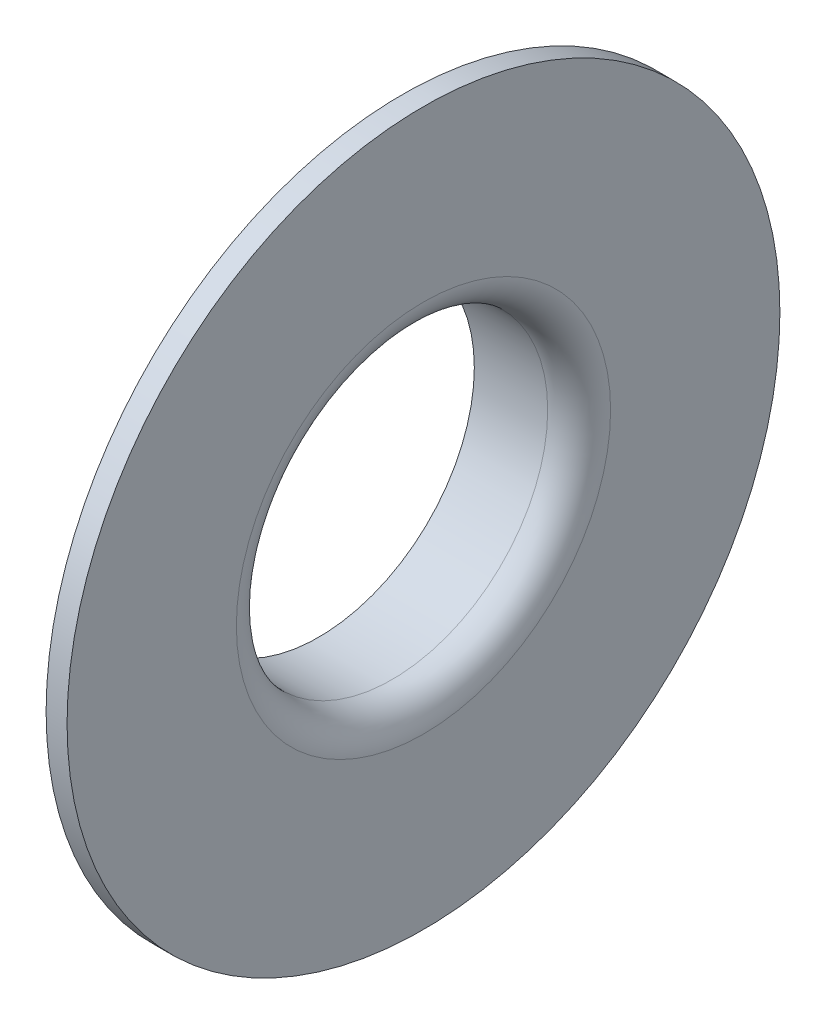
ISO-10303-21;
HEADER;
FILE_DESCRIPTION(('STEP AP214'),'2;1');
FILE_NAME('part.step','',(''),(''),'','','');
FILE_SCHEMA(('AUTOMOTIVE_DESIGN { 1 0 10303 214 1 1 1 1 }'));
ENDSEC;
DATA;
#1=APPLICATION_CONTEXT('core data for automotive mechanical design processes');
#2=APPLICATION_PROTOCOL_DEFINITION('international standard','automotive_design',2000,#1);
#3=PRODUCT_CONTEXT('',#1,'mechanical');
#4=PRODUCT('Part','Part','',(#3));
#5=PRODUCT_RELATED_PRODUCT_CATEGORY('part','',(#4));
#6=PRODUCT_DEFINITION_FORMATION('','',#4);
#7=PRODUCT_DEFINITION_CONTEXT('part definition',#1,'design');
#8=PRODUCT_DEFINITION('design','',#6,#7);
#9=PRODUCT_DEFINITION_SHAPE('','',#8);
#10=(LENGTH_UNIT() NAMED_UNIT(*) SI_UNIT(.MILLI.,.METRE.));
#11=(NAMED_UNIT(*) PLANE_ANGLE_UNIT() SI_UNIT($,.RADIAN.));
#12=(NAMED_UNIT(*) SI_UNIT($,.STERADIAN.) SOLID_ANGLE_UNIT());
#13=UNCERTAINTY_MEASURE_WITH_UNIT(LENGTH_MEASURE(1.E-05),#10,'distance_accuracy_value','');
#14=(GEOMETRIC_REPRESENTATION_CONTEXT(3) GLOBAL_UNCERTAINTY_ASSIGNED_CONTEXT((#13)) GLOBAL_UNIT_ASSIGNED_CONTEXT((#10,
#11,#12)) REPRESENTATION_CONTEXT('',''));
#15=CARTESIAN_POINT('',(0.,0.,0.));
#16=DIRECTION('',(0.,0.,1.));
#17=DIRECTION('',(1.,0.,0.));
#18=AXIS2_PLACEMENT_3D('',#15,#16,#17);
#19=CARTESIAN_POINT('',(10.,17.85,0.));
#20=DIRECTION('',(-1.,0.,0.));
#21=DIRECTION('',(0.,0.,1.));
#22=AXIS2_PLACEMENT_3D('',#19,#20,#21);
#23=PLANE('',#22);
#24=CARTESIAN_POINT('',(10.,0.,0.));
#25=DIRECTION('',(-1.,0.,0.));
#26=DIRECTION('',(0.,0.,1.));
#27=AXIS2_PLACEMENT_3D('',#24,#25,#26);
#28=CIRCLE('',#27,34.);
#29=CARTESIAN_POINT('',(10.,0.,34.));
#30=VERTEX_POINT('',#29);
#31=EDGE_CURVE('E10',#30,#30,#28,.T.);
#32=ORIENTED_EDGE('',*,*,#31,.F.);
#33=EDGE_LOOP('',(#32));
#34=FACE_BOUND('',#33,.T.);
#35=CARTESIAN_POINT('',(10.,0.,0.));
#36=DIRECTION('',(-1.,0.,0.));
#37=DIRECTION('',(0.,0.,1.));
#38=AXIS2_PLACEMENT_3D('',#35,#36,#37);
#39=CIRCLE('',#38,17.85);
#40=CARTESIAN_POINT('',(10.,0.,17.85));
#41=VERTEX_POINT('',#40);
#42=EDGE_CURVE('E56',#41,#41,#39,.T.);
#43=ORIENTED_EDGE('',*,*,#42,.T.);
#44=EDGE_LOOP('',(#43));
#45=FACE_BOUND('',#44,.T.);
#46=ADVANCED_FACE('F28',(#34,#45),#23,.F.);
#47=CARTESIAN_POINT('',(0.,0.,0.));
#48=DIRECTION('',(-1.,0.,0.));
#49=DIRECTION('',(0.,0.,1.));
#50=AXIS2_PLACEMENT_3D('',#47,#48,#49);
#51=CYLINDRICAL_SURFACE('',#50,34.);
#52=ORIENTED_EDGE('',*,*,#31,.T.);
#53=EDGE_LOOP('',(#52));
#54=FACE_BOUND('',#53,.T.);
#55=CARTESIAN_POINT('',(8.,0.,0.));
#56=DIRECTION('',(-1.,0.,0.));
#57=DIRECTION('',(0.,0.,1.));
#58=AXIS2_PLACEMENT_3D('',#55,#56,#57);
#59=CIRCLE('',#58,34.);
#60=CARTESIAN_POINT('',(8.,0.,34.));
#61=VERTEX_POINT('',#60);
#62=EDGE_CURVE('E34',#61,#61,#59,.T.);
#63=ORIENTED_EDGE('',*,*,#62,.F.);
#64=EDGE_LOOP('',(#63));
#65=FACE_BOUND('',#64,.T.);
#66=ADVANCED_FACE('F85',(#54,#65),#51,.T.);
#67=CARTESIAN_POINT('',(8.,17.85,0.));
#68=DIRECTION('',(-1.,0.,0.));
#69=DIRECTION('',(0.,0.,1.));
#70=AXIS2_PLACEMENT_3D('',#67,#68,#69);
#71=PLANE('',#70);
#72=ORIENTED_EDGE('',*,*,#62,.T.);
#73=EDGE_LOOP('',(#72));
#74=FACE_BOUND('',#73,.T.);
#75=CARTESIAN_POINT('',(8.,0.,0.));
#76=DIRECTION('',(-1.,0.,0.));
#77=DIRECTION('',(0.,0.,1.));
#78=AXIS2_PLACEMENT_3D('',#75,#76,#77);
#79=CIRCLE('',#78,17.85);
#80=CARTESIAN_POINT('',(8.,0.,17.85));
#81=VERTEX_POINT('',#80);
#82=EDGE_CURVE('E38',#81,#81,#79,.T.);
#83=ORIENTED_EDGE('',*,*,#82,.F.);
#84=EDGE_LOOP('',(#83));
#85=FACE_BOUND('',#84,.T.);
#86=ADVANCED_FACE('F90',(#74,#85),#71,.T.);
#87=CARTESIAN_POINT('',(7.,0.,0.));
#88=DIRECTION('',(-1.,0.,0.));
#89=DIRECTION('',(0.,0.,1.));
#90=AXIS2_PLACEMENT_3D('',#87,#88,#89);
#91=TOROIDAL_SURFACE('',#90,17.85,1.);
#92=ORIENTED_EDGE('',*,*,#82,.T.);
#93=EDGE_LOOP('',(#92));
#94=FACE_BOUND('',#93,.T.);
#95=CARTESIAN_POINT('',(7.,0.,0.));
#96=DIRECTION('',(-1.,0.,0.));
#97=DIRECTION('',(0.,0.,1.));
#98=AXIS2_PLACEMENT_3D('',#95,#96,#97);
#99=CIRCLE('',#98,16.85);
#100=CARTESIAN_POINT('',(7.,0.,16.85));
#101=VERTEX_POINT('',#100);
#102=EDGE_CURVE('E42',#101,#101,#99,.T.);
#103=ORIENTED_EDGE('',*,*,#102,.F.);
#104=EDGE_LOOP('',(#103));
#105=FACE_BOUND('',#104,.T.);
#106=ADVANCED_FACE('F81',(#94,#105),#91,.F.);
#107=CARTESIAN_POINT('',(0.,0.,0.));
#108=DIRECTION('',(-1.,0.,0.));
#109=DIRECTION('',(0.,0.,1.));
#110=AXIS2_PLACEMENT_3D('',#107,#108,#109);
#111=CYLINDRICAL_SURFACE('',#110,16.85);
#112=ORIENTED_EDGE('',*,*,#102,.T.);
#113=EDGE_LOOP('',(#112));
#114=FACE_BOUND('',#113,.T.);
#115=CARTESIAN_POINT('',(0.,0.,0.));
#116=DIRECTION('',(-1.,0.,0.));
#117=DIRECTION('',(0.,0.,1.));
#118=AXIS2_PLACEMENT_3D('',#115,#116,#117);
#119=CIRCLE('',#118,16.85);
#120=CARTESIAN_POINT('',(0.,0.,16.85));
#121=VERTEX_POINT('',#120);
#122=EDGE_CURVE('E47',#121,#121,#119,.T.);
#123=ORIENTED_EDGE('',*,*,#122,.F.);
#124=EDGE_LOOP('',(#123));
#125=FACE_BOUND('',#124,.T.);
#126=ADVANCED_FACE('F75',(#114,#125),#111,.T.);
#127=CARTESIAN_POINT('',(0.,14.85,0.));
#128=DIRECTION('',(-1.,0.,0.));
#129=DIRECTION('',(0.,0.,1.));
#130=AXIS2_PLACEMENT_3D('',#127,#128,#129);
#131=PLANE('',#130);
#132=ORIENTED_EDGE('',*,*,#122,.T.);
#133=EDGE_LOOP('',(#132));
#134=FACE_BOUND('',#133,.T.);
#135=CARTESIAN_POINT('',(0.,0.,0.));
#136=DIRECTION('',(-1.,0.,0.));
#137=DIRECTION('',(0.,0.,1.));
#138=AXIS2_PLACEMENT_3D('',#135,#136,#137);
#139=CIRCLE('',#138,14.85);
#140=CARTESIAN_POINT('',(0.,0.,14.85));
#141=VERTEX_POINT('',#140);
#142=EDGE_CURVE('E50',#141,#141,#139,.T.);
#143=ORIENTED_EDGE('',*,*,#142,.F.);
#144=EDGE_LOOP('',(#143));
#145=FACE_BOUND('',#144,.T.);
#146=ADVANCED_FACE('F70',(#134,#145),#131,.T.);
#147=CARTESIAN_POINT('',(0.,0.,0.));
#148=DIRECTION('',(-1.,0.,0.));
#149=DIRECTION('',(0.,0.,1.));
#150=AXIS2_PLACEMENT_3D('',#147,#148,#149);
#151=CYLINDRICAL_SURFACE('',#150,14.85);
#152=CARTESIAN_POINT('',(7.,0.,0.));
#153=DIRECTION('',(-1.,0.,0.));
#154=DIRECTION('',(0.,0.,1.));
#155=AXIS2_PLACEMENT_3D('',#152,#153,#154);
#156=CIRCLE('',#155,14.85);
#157=CARTESIAN_POINT('',(7.,0.,14.85));
#158=VERTEX_POINT('',#157);
#159=EDGE_CURVE('E53',#158,#158,#156,.T.);
#160=ORIENTED_EDGE('',*,*,#159,.F.);
#161=EDGE_LOOP('',(#160));
#162=FACE_BOUND('',#161,.T.);
#163=ORIENTED_EDGE('',*,*,#142,.T.);
#164=EDGE_LOOP('',(#163));
#165=FACE_BOUND('',#164,.T.);
#166=ADVANCED_FACE('F64',(#162,#165),#151,.F.);
#167=CARTESIAN_POINT('',(7.,0.,0.));
#168=DIRECTION('',(-1.,0.,0.));
#169=DIRECTION('',(0.,0.,1.));
#170=AXIS2_PLACEMENT_3D('',#167,#168,#169);
#171=TOROIDAL_SURFACE('',#170,17.85,3.);
#172=ORIENTED_EDGE('',*,*,#42,.F.);
#173=EDGE_LOOP('',(#172));
#174=FACE_BOUND('',#173,.T.);
#175=ORIENTED_EDGE('',*,*,#159,.T.);
#176=EDGE_LOOP('',(#175));
#177=FACE_BOUND('',#176,.T.);
#178=ADVANCED_FACE('F61',(#174,#177),#171,.T.);
#179=CLOSED_SHELL('',(#46,#66,#86,#106,#126,#146,#166,#178));
#180=MANIFOLD_SOLID_BREP('B2',#179);
#181=ADVANCED_BREP_SHAPE_REPRESENTATION('',(#18,#180),#14);
#182=SHAPE_DEFINITION_REPRESENTATION(#9,#181);
ENDSEC;
END-ISO-10303-21;
